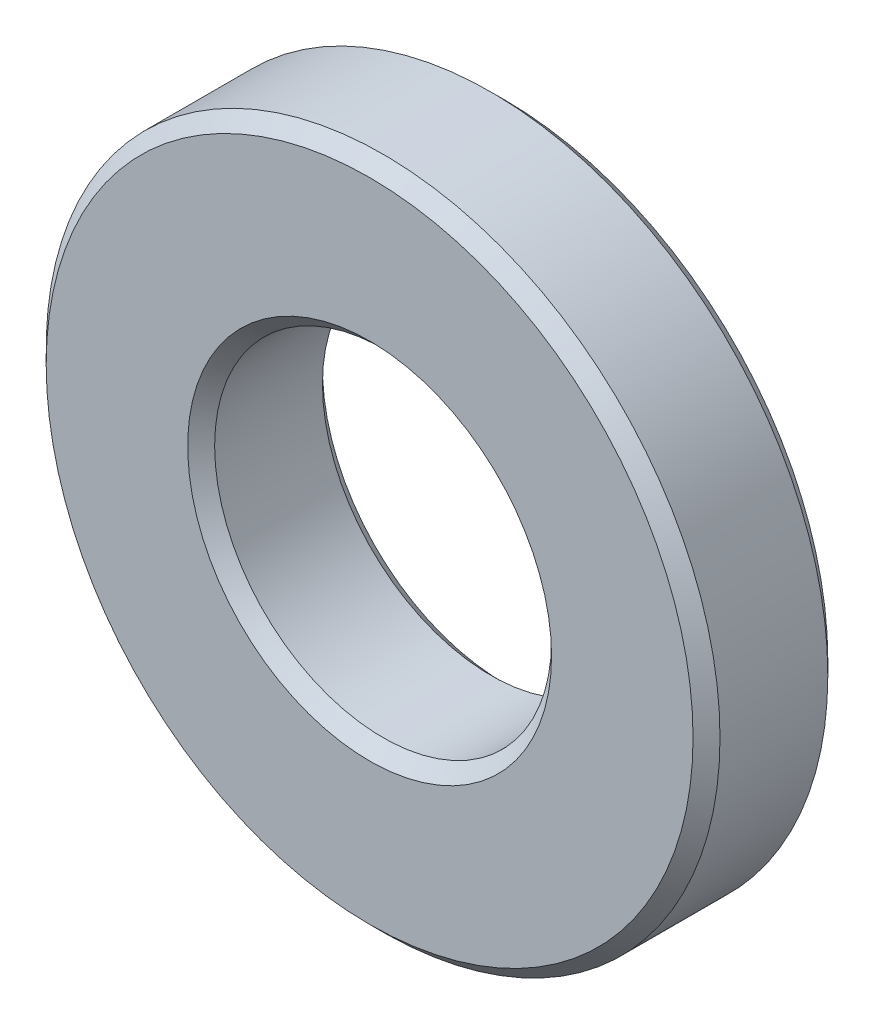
ISO-10303-21;
HEADER;
FILE_DESCRIPTION(('STEP AP214'),'2;1');
FILE_NAME('part.step','',(''),(''),'','','');
FILE_SCHEMA(('AUTOMOTIVE_DESIGN { 1 0 10303 214 1 1 1 1 }'));
ENDSEC;
DATA;
#1=APPLICATION_CONTEXT('core data for automotive mechanical design processes');
#2=APPLICATION_PROTOCOL_DEFINITION('international standard','automotive_design',2000,#1);
#3=PRODUCT_CONTEXT('',#1,'mechanical');
#4=PRODUCT('Part','Part','',(#3));
#5=PRODUCT_RELATED_PRODUCT_CATEGORY('part','',(#4));
#6=PRODUCT_DEFINITION_FORMATION('','',#4);
#7=PRODUCT_DEFINITION_CONTEXT('part definition',#1,'design');
#8=PRODUCT_DEFINITION('design','',#6,#7);
#9=PRODUCT_DEFINITION_SHAPE('','',#8);
#10=(LENGTH_UNIT() NAMED_UNIT(*) SI_UNIT(.MILLI.,.METRE.));
#11=(NAMED_UNIT(*) PLANE_ANGLE_UNIT() SI_UNIT($,.RADIAN.));
#12=(NAMED_UNIT(*) SI_UNIT($,.STERADIAN.) SOLID_ANGLE_UNIT());
#13=UNCERTAINTY_MEASURE_WITH_UNIT(LENGTH_MEASURE(1.E-05),#10,'distance_accuracy_value','');
#14=(GEOMETRIC_REPRESENTATION_CONTEXT(3) GLOBAL_UNCERTAINTY_ASSIGNED_CONTEXT((#13)) GLOBAL_UNIT_ASSIGNED_CONTEXT((#10,
#11,#12)) REPRESENTATION_CONTEXT('',''));
#15=CARTESIAN_POINT('',(0.,0.,0.));
#16=DIRECTION('',(0.,0.,1.));
#17=DIRECTION('',(1.,0.,0.));
#18=AXIS2_PLACEMENT_3D('',#15,#16,#17);
#19=CARTESIAN_POINT('',(0.,0.,0.5));
#20=DIRECTION('',(0.,0.,1.));
#21=DIRECTION('',(1.,0.,0.));
#22=AXIS2_PLACEMENT_3D('',#19,#20,#21);
#23=PLANE('',#22);
#24=CARTESIAN_POINT('',(0.,0.,0.5));
#25=DIRECTION('',(0.,0.,1.));
#26=DIRECTION('',(1.,0.,0.));
#27=AXIS2_PLACEMENT_3D('',#24,#25,#26);
#28=CIRCLE('',#27,1.35);
#29=CARTESIAN_POINT('',(1.35,0.,0.5));
#30=VERTEX_POINT('',#29);
#31=EDGE_CURVE('E10',#30,#30,#28,.F.);
#32=ORIENTED_EDGE('',*,*,#31,.T.);
#33=EDGE_LOOP('',(#32));
#34=FACE_BOUND('',#33,.T.);
#35=CARTESIAN_POINT('',(0.,0.,0.5));
#36=DIRECTION('',(0.,0.,1.));
#37=DIRECTION('',(1.,0.,0.));
#38=AXIS2_PLACEMENT_3D('',#35,#36,#37);
#39=CIRCLE('',#38,2.4);
#40=CARTESIAN_POINT('',(2.4,0.,0.5));
#41=VERTEX_POINT('',#40);
#42=EDGE_CURVE('E45',#41,#41,#39,.T.);
#43=ORIENTED_EDGE('',*,*,#42,.T.);
#44=EDGE_LOOP('',(#43));
#45=FACE_BOUND('',#44,.T.);
#46=ADVANCED_FACE('F37',(#34,#45),#23,.T.);
#47=CARTESIAN_POINT('',(0.,0.,-0.5));
#48=DIRECTION('',(0.,0.,1.));
#49=DIRECTION('',(1.,0.,0.));
#50=AXIS2_PLACEMENT_3D('',#47,#48,#49);
#51=PLANE('',#50);
#52=CARTESIAN_POINT('',(0.,0.,-0.5));
#53=DIRECTION('',(0.,0.,1.));
#54=DIRECTION('',(1.,0.,0.));
#55=AXIS2_PLACEMENT_3D('',#52,#53,#54);
#56=CIRCLE('',#55,2.4);
#57=CARTESIAN_POINT('',(2.4,0.,-0.5));
#58=VERTEX_POINT('',#57);
#59=EDGE_CURVE('E64',#58,#58,#56,.F.);
#60=ORIENTED_EDGE('',*,*,#59,.T.);
#61=EDGE_LOOP('',(#60));
#62=FACE_BOUND('',#61,.T.);
#63=CARTESIAN_POINT('',(0.,0.,-0.5));
#64=DIRECTION('',(0.,0.,1.));
#65=DIRECTION('',(1.,0.,0.));
#66=AXIS2_PLACEMENT_3D('',#63,#64,#65);
#67=CIRCLE('',#66,1.35);
#68=CARTESIAN_POINT('',(1.35,0.,-0.5));
#69=VERTEX_POINT('',#68);
#70=EDGE_CURVE('E67',#69,#69,#67,.T.);
#71=ORIENTED_EDGE('',*,*,#70,.T.);
#72=EDGE_LOOP('',(#71));
#73=FACE_BOUND('',#72,.T.);
#74=ADVANCED_FACE('F89',(#62,#73),#51,.F.);
#75=CARTESIAN_POINT('',(0.,0.,0.5));
#76=DIRECTION('',(0.,0.,-1.));
#77=DIRECTION('',(-1.,0.,0.));
#78=AXIS2_PLACEMENT_3D('',#75,#76,#77);
#79=CYLINDRICAL_SURFACE('',#78,2.5);
#80=CARTESIAN_POINT('',(0.,0.,-0.4));
#81=DIRECTION('',(0.,0.,1.));
#82=DIRECTION('',(1.,0.,0.));
#83=AXIS2_PLACEMENT_3D('',#80,#81,#82);
#84=CIRCLE('',#83,2.5);
#85=CARTESIAN_POINT('',(2.5,0.,-0.4));
#86=VERTEX_POINT('',#85);
#87=EDGE_CURVE('E70',#86,#86,#84,.T.);
#88=ORIENTED_EDGE('',*,*,#87,.T.);
#89=EDGE_LOOP('',(#88));
#90=FACE_BOUND('',#89,.T.);
#91=CARTESIAN_POINT('',(0.,0.,0.400000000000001));
#92=DIRECTION('',(0.,0.,1.));
#93=DIRECTION('',(1.,0.,0.));
#94=AXIS2_PLACEMENT_3D('',#91,#92,#93);
#95=CIRCLE('',#94,2.5);
#96=CARTESIAN_POINT('',(2.5,0.,0.400000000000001));
#97=VERTEX_POINT('',#96);
#98=EDGE_CURVE('E74',#97,#97,#95,.F.);
#99=ORIENTED_EDGE('',*,*,#98,.T.);
#100=EDGE_LOOP('',(#99));
#101=FACE_BOUND('',#100,.T.);
#102=ADVANCED_FACE('F78',(#90,#101),#79,.T.);
#103=CARTESIAN_POINT('',(0.,0.,0.5));
#104=DIRECTION('',(0.,0.,-1.));
#105=DIRECTION('',(-1.,0.,0.));
#106=AXIS2_PLACEMENT_3D('',#103,#104,#105);
#107=CYLINDRICAL_SURFACE('',#106,1.25);
#108=CARTESIAN_POINT('',(0.,0.,-0.4));
#109=DIRECTION('',(0.,0.,1.));
#110=DIRECTION('',(1.,0.,0.));
#111=AXIS2_PLACEMENT_3D('',#108,#109,#110);
#112=CIRCLE('',#111,1.25);
#113=CARTESIAN_POINT('',(1.25,0.,-0.4));
#114=VERTEX_POINT('',#113);
#115=EDGE_CURVE('E51',#114,#114,#112,.F.);
#116=ORIENTED_EDGE('',*,*,#115,.T.);
#117=EDGE_LOOP('',(#116));
#118=FACE_BOUND('',#117,.T.);
#119=CARTESIAN_POINT('',(0.,0.,0.400000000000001));
#120=DIRECTION('',(0.,0.,1.));
#121=DIRECTION('',(1.,0.,0.));
#122=AXIS2_PLACEMENT_3D('',#119,#120,#121);
#123=CIRCLE('',#122,1.25);
#124=CARTESIAN_POINT('',(1.25,0.,0.400000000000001));
#125=VERTEX_POINT('',#124);
#126=EDGE_CURVE('E58',#125,#125,#123,.T.);
#127=ORIENTED_EDGE('',*,*,#126,.T.);
#128=EDGE_LOOP('',(#127));
#129=FACE_BOUND('',#128,.T.);
#130=ADVANCED_FACE('F97',(#118,#129),#107,.F.);
#131=CARTESIAN_POINT('',(0.,0.,-0.4));
#132=DIRECTION('',(0.,0.,1.));
#133=DIRECTION('',(1.,0.,0.));
#134=AXIS2_PLACEMENT_3D('',#131,#132,#133);
#135=CONICAL_SURFACE('',#134,2.5,0.785398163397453);
#136=CARTESIAN_POINT('',(2.4,0.,-0.5));
#137=CARTESIAN_POINT('',(2.40104166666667,0.,-0.498958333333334));
#138=CARTESIAN_POINT('',(2.40208333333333,0.,-0.497916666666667));
#139=CARTESIAN_POINT('',(2.40416666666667,0.,-0.495833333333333));
#140=CARTESIAN_POINT('',(2.40520833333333,0.,-0.494791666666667));
#141=CARTESIAN_POINT('',(2.40729166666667,0.,-0.492708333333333));
#142=CARTESIAN_POINT('',(2.40833333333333,0.,-0.491666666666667));
#143=CARTESIAN_POINT('',(2.41041666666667,0.,-0.489583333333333));
#144=CARTESIAN_POINT('',(2.41145833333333,0.,-0.488541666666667));
#145=CARTESIAN_POINT('',(2.41354166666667,0.,-0.486458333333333));
#146=CARTESIAN_POINT('',(2.41458333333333,0.,-0.485416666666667));
#147=CARTESIAN_POINT('',(2.41666666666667,0.,-0.483333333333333));
#148=CARTESIAN_POINT('',(2.41770833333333,0.,-0.482291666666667));
#149=CARTESIAN_POINT('',(2.41979166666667,0.,-0.480208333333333));
#150=CARTESIAN_POINT('',(2.42083333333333,0.,-0.479166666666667));
#151=CARTESIAN_POINT('',(2.42291666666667,0.,-0.477083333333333));
#152=CARTESIAN_POINT('',(2.42395833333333,0.,-0.476041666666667));
#153=CARTESIAN_POINT('',(2.42604166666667,0.,-0.473958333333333));
#154=CARTESIAN_POINT('',(2.42708333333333,0.,-0.472916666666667));
#155=CARTESIAN_POINT('',(2.42916666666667,0.,-0.470833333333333));
#156=CARTESIAN_POINT('',(2.43020833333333,0.,-0.469791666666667));
#157=CARTESIAN_POINT('',(2.43229166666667,0.,-0.467708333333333));
#158=CARTESIAN_POINT('',(2.43333333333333,0.,-0.466666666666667));
#159=CARTESIAN_POINT('',(2.43541666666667,0.,-0.464583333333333));
#160=CARTESIAN_POINT('',(2.43645833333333,0.,-0.463541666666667));
#161=CARTESIAN_POINT('',(2.43854166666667,0.,-0.461458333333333));
#162=CARTESIAN_POINT('',(2.43958333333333,0.,-0.460416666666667));
#163=CARTESIAN_POINT('',(2.44166666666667,0.,-0.458333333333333));
#164=CARTESIAN_POINT('',(2.44270833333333,0.,-0.457291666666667));
#165=CARTESIAN_POINT('',(2.44479166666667,0.,-0.455208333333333));
#166=CARTESIAN_POINT('',(2.44583333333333,0.,-0.454166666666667));
#167=CARTESIAN_POINT('',(2.44791666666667,0.,-0.452083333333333));
#168=CARTESIAN_POINT('',(2.44895833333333,0.,-0.451041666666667));
#169=CARTESIAN_POINT('',(2.45104166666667,0.,-0.448958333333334));
#170=CARTESIAN_POINT('',(2.45208333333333,0.,-0.447916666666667));
#171=CARTESIAN_POINT('',(2.45416666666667,0.,-0.445833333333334));
#172=CARTESIAN_POINT('',(2.45520833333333,0.,-0.444791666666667));
#173=CARTESIAN_POINT('',(2.45729166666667,0.,-0.442708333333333));
#174=CARTESIAN_POINT('',(2.45833333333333,0.,-0.441666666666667));
#175=CARTESIAN_POINT('',(2.46041666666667,0.,-0.439583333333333));
#176=CARTESIAN_POINT('',(2.46145833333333,0.,-0.438541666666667));
#177=CARTESIAN_POINT('',(2.46354166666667,0.,-0.436458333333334));
#178=CARTESIAN_POINT('',(2.46458333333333,0.,-0.435416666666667));
#179=CARTESIAN_POINT('',(2.46666666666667,0.,-0.433333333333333));
#180=CARTESIAN_POINT('',(2.46770833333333,0.,-0.432291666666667));
#181=CARTESIAN_POINT('',(2.46979166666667,0.,-0.430208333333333));
#182=CARTESIAN_POINT('',(2.47083333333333,0.,-0.429166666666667));
#183=CARTESIAN_POINT('',(2.47291666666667,0.,-0.427083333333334));
#184=CARTESIAN_POINT('',(2.47395833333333,0.,-0.426041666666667));
#185=CARTESIAN_POINT('',(2.47604166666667,0.,-0.423958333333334));
#186=CARTESIAN_POINT('',(2.47708333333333,0.,-0.422916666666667));
#187=CARTESIAN_POINT('',(2.47916666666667,0.,-0.420833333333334));
#188=CARTESIAN_POINT('',(2.48020833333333,0.,-0.419791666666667));
#189=CARTESIAN_POINT('',(2.48229166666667,0.,-0.417708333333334));
#190=CARTESIAN_POINT('',(2.48333333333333,0.,-0.416666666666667));
#191=CARTESIAN_POINT('',(2.48541666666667,0.,-0.414583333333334));
#192=CARTESIAN_POINT('',(2.48645833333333,0.,-0.413541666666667));
#193=CARTESIAN_POINT('',(2.48854166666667,0.,-0.411458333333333));
#194=CARTESIAN_POINT('',(2.48958333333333,0.,-0.410416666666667));
#195=CARTESIAN_POINT('',(2.49166666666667,0.,-0.408333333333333));
#196=CARTESIAN_POINT('',(2.49270833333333,0.,-0.407291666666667));
#197=CARTESIAN_POINT('',(2.49479166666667,0.,-0.405208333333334));
#198=CARTESIAN_POINT('',(2.49583333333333,0.,-0.404166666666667));
#199=CARTESIAN_POINT('',(2.49791666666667,0.,-0.402083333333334));
#200=CARTESIAN_POINT('',(2.49895833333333,0.,-0.401041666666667));
#201=CARTESIAN_POINT('',(2.5,0.,-0.4));
#202=B_SPLINE_CURVE_WITH_KNOTS('',3,(#136,#137,#138,#139,#140,#141,#142,#143,#144,#145,#146,
#147,#148,#149,#150,#151,#152,#153,#154,#155,#156,#157,#158,#159,#160,#161,#162,#163,#164,#165,
#166,#167,#168,#169,#170,#171,#172,#173,#174,#175,#176,#177,#178,#179,#180,#181,#182,#183,#184,
#185,#186,#187,#188,#189,#190,#191,#192,#193,#194,#195,#196,#197,#198,#199,#200,#201),
.UNSPECIFIED.,.F.,.F.,(4,2,2,2,2,2,2,2,2,2,2,2,2,2,2,2,2,2,2,2,2,2,2,2,2,2,2,2,2,2,2,2,4),(0.,
0.00441941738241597,0.00883883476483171,0.0132582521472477,0.0176776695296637,
0.0220970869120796,0.0265165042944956,0.0309359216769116,0.0353553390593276,0.0397747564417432,
0.0441941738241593,0.0486135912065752,0.0530330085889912,0.0574524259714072,0.0618718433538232,
0.0662912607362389,0.0707106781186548,0.0751300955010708,0.0795495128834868,0.0839689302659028,
0.0883883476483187,0.0928077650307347,0.0972271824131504,0.101646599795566,0.106066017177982,
0.110485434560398,0.114904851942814,0.11932426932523,0.123743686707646,0.128163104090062,
0.132582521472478,0.137001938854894,0.14142135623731),.UNSPECIFIED.);
#203=EDGE_CURVE('BSEAM102',#58,#86,#202,.T.);
#204=ORIENTED_EDGE('',*,*,#59,.F.);
#205=ORIENTED_EDGE('',*,*,#87,.F.);
#206=ORIENTED_EDGE('',*,*,#203,.T.);
#207=ORIENTED_EDGE('',*,*,#203,.F.);
#208=EDGE_LOOP('',(#204,#206,#205,#207));
#209=FACE_BOUND('',#208,.T.);
#210=ADVANCED_FACE('F102',(#209),#135,.T.);
#211=CARTESIAN_POINT('',(0.,0.,-0.5));
#212=DIRECTION('',(0.,0.,-1.));
#213=DIRECTION('',(-1.,0.,0.));
#214=AXIS2_PLACEMENT_3D('',#211,#212,#213);
#215=CONICAL_SURFACE('',#214,1.35,0.785398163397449);
#216=ORIENTED_EDGE('',*,*,#115,.F.);
#217=EDGE_LOOP('',(#216));
#218=FACE_BOUND('',#217,.T.);
#219=ORIENTED_EDGE('',*,*,#70,.F.);
#220=EDGE_LOOP('',(#219));
#221=FACE_BOUND('',#220,.T.);
#222=ADVANCED_FACE('F86',(#218,#221),#215,.F.);
#223=CARTESIAN_POINT('',(0.,0.,0.400000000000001));
#224=DIRECTION('',(0.,0.,1.));
#225=DIRECTION('',(1.,0.,0.));
#226=AXIS2_PLACEMENT_3D('',#223,#224,#225);
#227=CONICAL_SURFACE('',#226,1.25,0.78539816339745);
#228=ORIENTED_EDGE('',*,*,#31,.F.);
#229=EDGE_LOOP('',(#228));
#230=FACE_BOUND('',#229,.T.);
#231=ORIENTED_EDGE('',*,*,#126,.F.);
#232=EDGE_LOOP('',(#231));
#233=FACE_BOUND('',#232,.T.);
#234=ADVANCED_FACE('F82',(#230,#233),#227,.F.);
#235=CARTESIAN_POINT('',(0.,0.,0.5));
#236=DIRECTION('',(0.,0.,-1.));
#237=DIRECTION('',(-1.,0.,0.));
#238=AXIS2_PLACEMENT_3D('',#235,#236,#237);
#239=CONICAL_SURFACE('',#238,2.4,0.78539816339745);
#240=ORIENTED_EDGE('',*,*,#98,.F.);
#241=EDGE_LOOP('',(#240));
#242=FACE_BOUND('',#241,.T.);
#243=ORIENTED_EDGE('',*,*,#42,.F.);
#244=EDGE_LOOP('',(#243));
#245=FACE_BOUND('',#244,.T.);
#246=ADVANCED_FACE('F39',(#242,#245),#239,.T.);
#247=CLOSED_SHELL('',(#46,#74,#102,#130,#210,#222,#234,#246));
#248=MANIFOLD_SOLID_BREP('B2',#247);
#249=ADVANCED_BREP_SHAPE_REPRESENTATION('',(#18,#248),#14);
#250=SHAPE_DEFINITION_REPRESENTATION(#9,#249);
ENDSEC;
END-ISO-10303-21;
